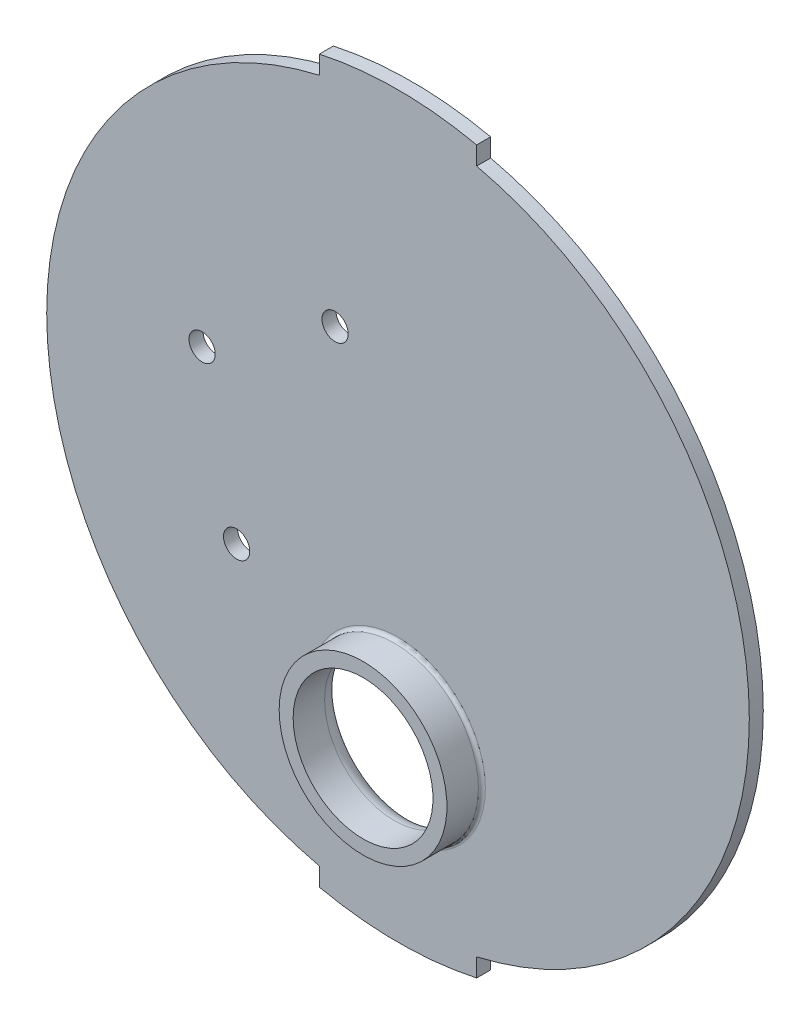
from build123d import *

# Parameters (mm, degrees)
ESQUISSE1_R             = 20.1
ESQUISSE1_R_2           = 4
BOSS_EXTRU_1_DEPTH      = 0.8
ESQUISSE2_R             = 0.75
ENL_V_MAT_EXTRU_1_DEPTH = 38.038628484
ESQUISSE3_R             = 4.8
ESQUISSE3_R_2           = 4
BOSS_EXTRU_2_DEPTH      = 2
CONG_1_R                = 1
CONG_2_R                = 0.2
BOSS_EXTRU_3_START      = -0.8
BOSS_EXTRU_3_DEPTH      = 0.8


with BuildPart() as part:
    # Esquisse1 → Boss.-Extru.1 (new body)
    with BuildSketch(Plane.XY):
        with Locations((0, 11)):
            Circle(ESQUISSE1_R)
        Circle(ESQUISSE1_R_2, mode=Mode.SUBTRACT)
    extrude(amount=BOSS_EXTRU_1_DEPTH)

    # Esquisse2 → Enl_v. mat.-Extru.1 (cut, through all)
    with BuildSketch(Plane.XY.offset(0.8)):
        with Locations((-3.6, 18.589466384)):
            Circle(ESQUISSE2_R)
        with Locations((-11.207630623, 13.780728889)):
            Circle(ESQUISSE2_R)
        with Locations((-9.233092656, 5)):
            Circle(ESQUISSE2_R)
    extrude(amount=-ENL_V_MAT_EXTRU_1_DEPTH, mode=Mode.SUBTRACT)

    # Esquisse3 → Boss.-Extru.2 (add)
    with BuildSketch(Plane(origin=(0, 0, 0.8), x_dir=(-1, 0, 0), z_dir=(0, 0, -1))):
        Circle(ESQUISSE3_R)
        Circle(ESQUISSE3_R_2, mode=Mode.SUBTRACT)
    extrude(amount=-BOSS_EXTRU_2_DEPTH)

    # Cong_1
    cong_1_edges = [part.edges().sort_by_distance(p)[0] for p in [
        (-4, 0, 0),
    ]]
    fillet(cong_1_edges, radius=CONG_1_R)

    # Cong_2
    cong_2_edges = [part.edges().sort_by_distance(p)[0] for p in [
        (4.8, 0, 0.8),
    ]]
    fillet(cong_2_edges, radius=CONG_2_R)

    # Esquisse4 → Boss.-Extru.3 (add)
    with BuildSketch(Plane.XY.offset(0.8).offset(BOSS_EXTRU_3_START)):
        with BuildLine():
            Line((4.5, -8.589793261), (4.5, -9.640145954))
            ThreePointArc((4.5, -9.640145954), (0, -10.125), (-4.5, -9.640145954))
            Line((-4.5, -9.640145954), (-4.5, -8.589793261))
            ThreePointArc((-4.5, -8.589793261), (0, -9.1), (4.5, -8.589793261))
        make_face()
        with BuildLine():
            Line((4.5, 31.640145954), (4.5, 30.589793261))
            ThreePointArc((4.5, 30.589793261), (0, 31.1), (-4.5, 30.589793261))
            Line((-4.5, 30.589793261), (-4.5, 31.640145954))
            ThreePointArc((-4.5, 31.640145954), (0, 32.125), (4.5, 31.640145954))
        make_face()
    extrude(amount=BOSS_EXTRU_3_DEPTH)


solid = part.part
